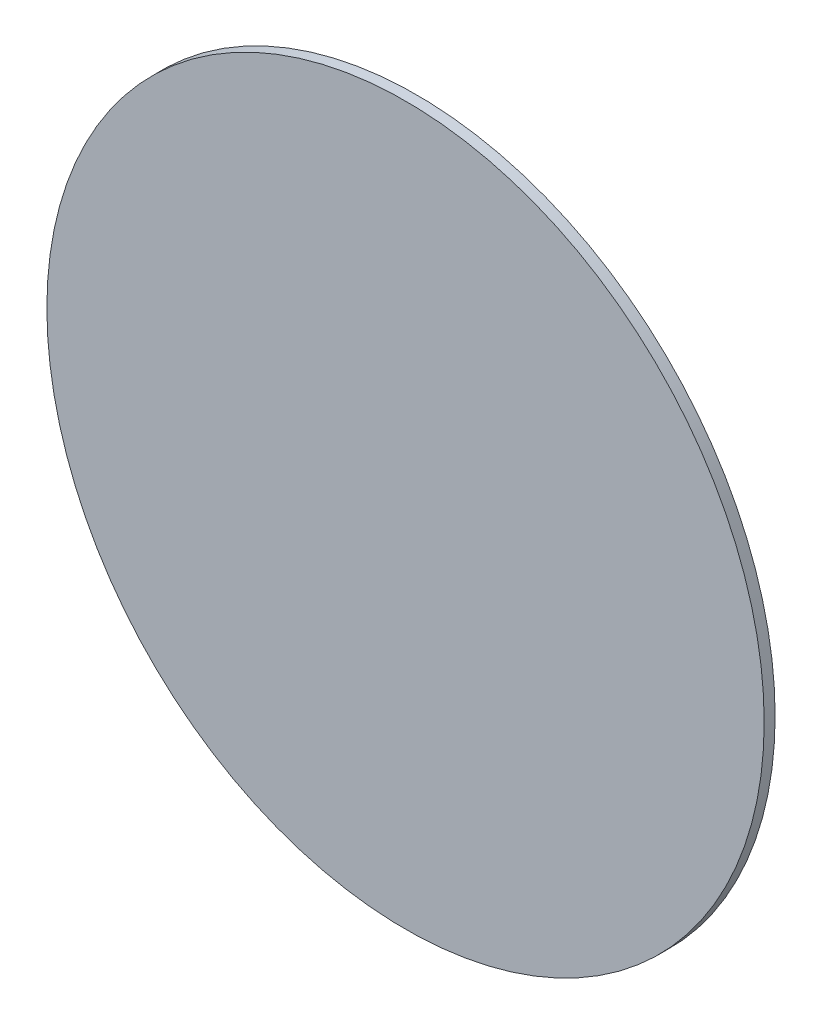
from build123d import *

# Parameters (mm, degrees)
SKETCH1_R      = 4
EXTRUDE1_DEPTH = 0.12192


with BuildPart() as part:
    # Sketch1 → Extrude1 (new body)
    with BuildSketch(Plane.XY):
        with Locations(Location((0, 0, 0), (0, 0, 180))):
            Circle(SKETCH1_R)
    extrude(amount=EXTRUDE1_DEPTH)


solid = part.part
